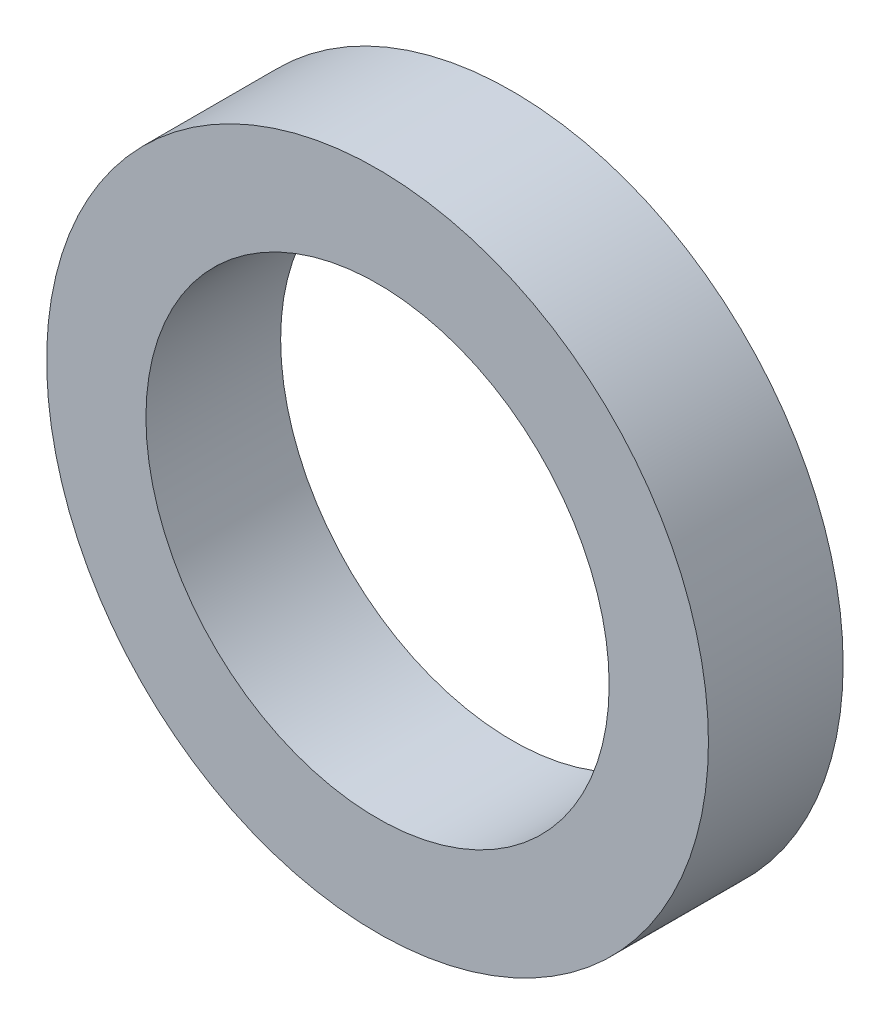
from build123d import *

# Parameters (mm, degrees)
ESQUISSE1_R      = 7
ESQUISSE1_R_2    = 4.9
EXTRUSION1_DEPTH = 2.85


with BuildPart() as part:
    # Esquisse1 → Extrusion1 (new body)
    with BuildSketch(Plane.XY):
        Circle(ESQUISSE1_R)
        Circle(ESQUISSE1_R_2, mode=Mode.SUBTRACT)
    extrude(amount=EXTRUSION1_DEPTH)


solid = part.part
